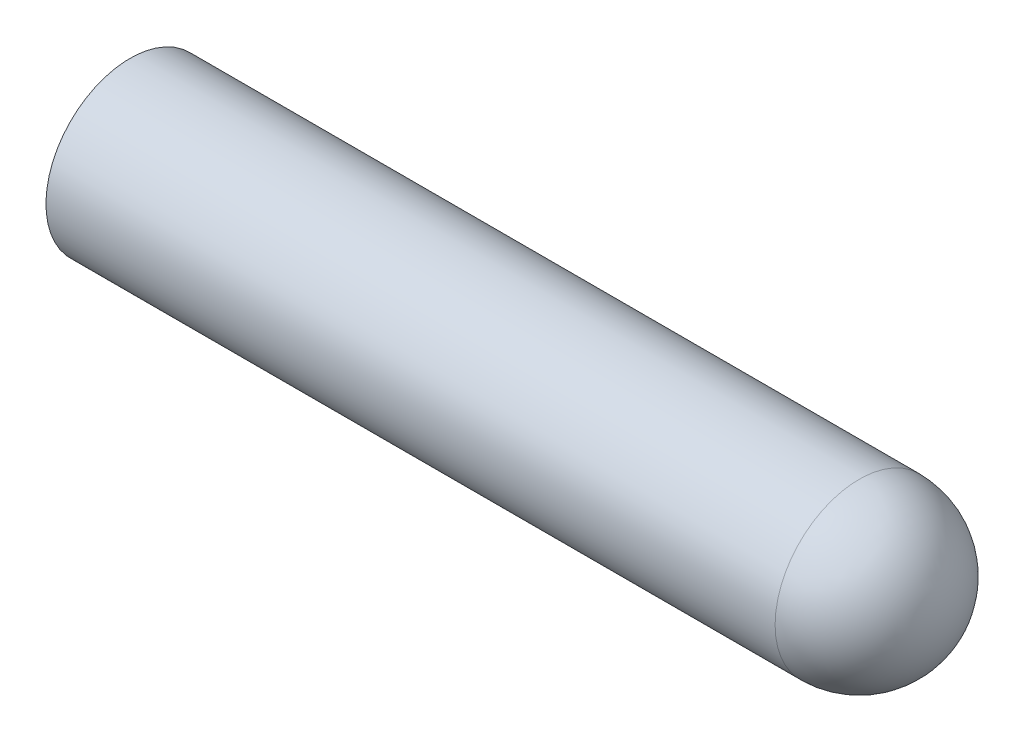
ISO-10303-21;
HEADER;
FILE_DESCRIPTION(('STEP AP214'),'2;1');
FILE_NAME('part.step','',(''),(''),'','','');
FILE_SCHEMA(('AUTOMOTIVE_DESIGN { 1 0 10303 214 1 1 1 1 }'));
ENDSEC;
DATA;
#1=APPLICATION_CONTEXT('core data for automotive mechanical design processes');
#2=APPLICATION_PROTOCOL_DEFINITION('international standard','automotive_design',2000,#1);
#3=PRODUCT_CONTEXT('',#1,'mechanical');
#4=PRODUCT('Part','Part','',(#3));
#5=PRODUCT_RELATED_PRODUCT_CATEGORY('part','',(#4));
#6=PRODUCT_DEFINITION_FORMATION('','',#4);
#7=PRODUCT_DEFINITION_CONTEXT('part definition',#1,'design');
#8=PRODUCT_DEFINITION('design','',#6,#7);
#9=PRODUCT_DEFINITION_SHAPE('','',#8);
#10=(LENGTH_UNIT() NAMED_UNIT(*) SI_UNIT(.MILLI.,.METRE.));
#11=(NAMED_UNIT(*) PLANE_ANGLE_UNIT() SI_UNIT($,.RADIAN.));
#12=(NAMED_UNIT(*) SI_UNIT($,.STERADIAN.) SOLID_ANGLE_UNIT());
#13=UNCERTAINTY_MEASURE_WITH_UNIT(LENGTH_MEASURE(1.E-05),#10,'distance_accuracy_value','');
#14=(GEOMETRIC_REPRESENTATION_CONTEXT(3) GLOBAL_UNCERTAINTY_ASSIGNED_CONTEXT((#13)) GLOBAL_UNIT_ASSIGNED_CONTEXT((#10,
#11,#12)) REPRESENTATION_CONTEXT('',''));
#15=CARTESIAN_POINT('',(0.,0.,0.));
#16=DIRECTION('',(0.,0.,1.));
#17=DIRECTION('',(1.,0.,0.));
#18=AXIS2_PLACEMENT_3D('',#15,#16,#17);
#19=CARTESIAN_POINT('',(-124.8725,19.9,0.));
#20=DIRECTION('',(-1.,0.,0.));
#21=DIRECTION('',(0.,-1.,0.));
#22=AXIS2_PLACEMENT_3D('',#19,#20,#21);
#23=CYLINDRICAL_SURFACE('',#22,1.4925);
#24=CARTESIAN_POINT('',(-126.365,19.9,0.));
#25=DIRECTION('',(-1.,0.,0.));
#26=DIRECTION('',(0.,0.,1.));
#27=AXIS2_PLACEMENT_3D('',#24,#25,#26);
#28=CIRCLE('',#27,1.4925);
#29=CARTESIAN_POINT('',(-126.365,19.9,1.4925));
#30=VERTEX_POINT('',#29);
#31=EDGE_CURVE('E10',#30,#30,#28,.T.);
#32=ORIENTED_EDGE('',*,*,#31,.T.);
#33=EDGE_LOOP('',(#32));
#34=FACE_BOUND('',#33,.T.);
#35=CARTESIAN_POINT('',(-139.3,19.9,0.));
#36=DIRECTION('',(-1.,0.,0.));
#37=DIRECTION('',(0.,-1.,0.));
#38=AXIS2_PLACEMENT_3D('',#35,#36,#37);
#39=CIRCLE('',#38,1.4925);
#40=CARTESIAN_POINT('',(-139.3,18.4075,0.));
#41=VERTEX_POINT('',#40);
#42=EDGE_CURVE('E21',#41,#41,#39,.T.);
#43=ORIENTED_EDGE('',*,*,#42,.F.);
#44=EDGE_LOOP('',(#43));
#45=FACE_BOUND('',#44,.T.);
#46=ADVANCED_FACE('F14',(#34,#45),#23,.T.);
#47=CARTESIAN_POINT('',(-139.3,19.9,0.));
#48=DIRECTION('',(-1.,0.,0.));
#49=DIRECTION('',(0.,-1.,0.));
#50=AXIS2_PLACEMENT_3D('',#47,#48,#49);
#51=PLANE('',#50);
#52=ORIENTED_EDGE('',*,*,#42,.T.);
#53=EDGE_LOOP('',(#52));
#54=FACE_BOUND('',#53,.T.);
#55=ADVANCED_FACE('F46',(#54),#51,.T.);
#56=CARTESIAN_POINT('',(-126.365,19.9,0.));
#57=DIRECTION('',(0.,0.,1.));
#58=DIRECTION('',(1.,0.,0.));
#59=AXIS2_PLACEMENT_3D('',#56,#57,#58);
#60=SPHERICAL_SURFACE('',#59,1.4925);
#61=CARTESIAN_POINT('',(-126.365,19.9,0.));
#62=DIRECTION('',(-1.,0.,0.));
#63=DIRECTION('',(0.,0.,1.));
#64=AXIS2_PLACEMENT_3D('',#61,#62,#63);
#65=SPHERICAL_SURFACE('',#64,1.4925);
#66=ORIENTED_EDGE('',*,*,#31,.F.);
#67=EDGE_LOOP('',(#66));
#68=FACE_BOUND('',#67,.T.);
#69=ADVANCED_FACE('F54',(#68),#65,.T.);
#70=CLOSED_SHELL('',(#46,#55,#69));
#71=MANIFOLD_SOLID_BREP('B1',#70);
#72=ADVANCED_BREP_SHAPE_REPRESENTATION('',(#18,#71),#14);
#73=SHAPE_DEFINITION_REPRESENTATION(#9,#72);
ENDSEC;
END-ISO-10303-21;
